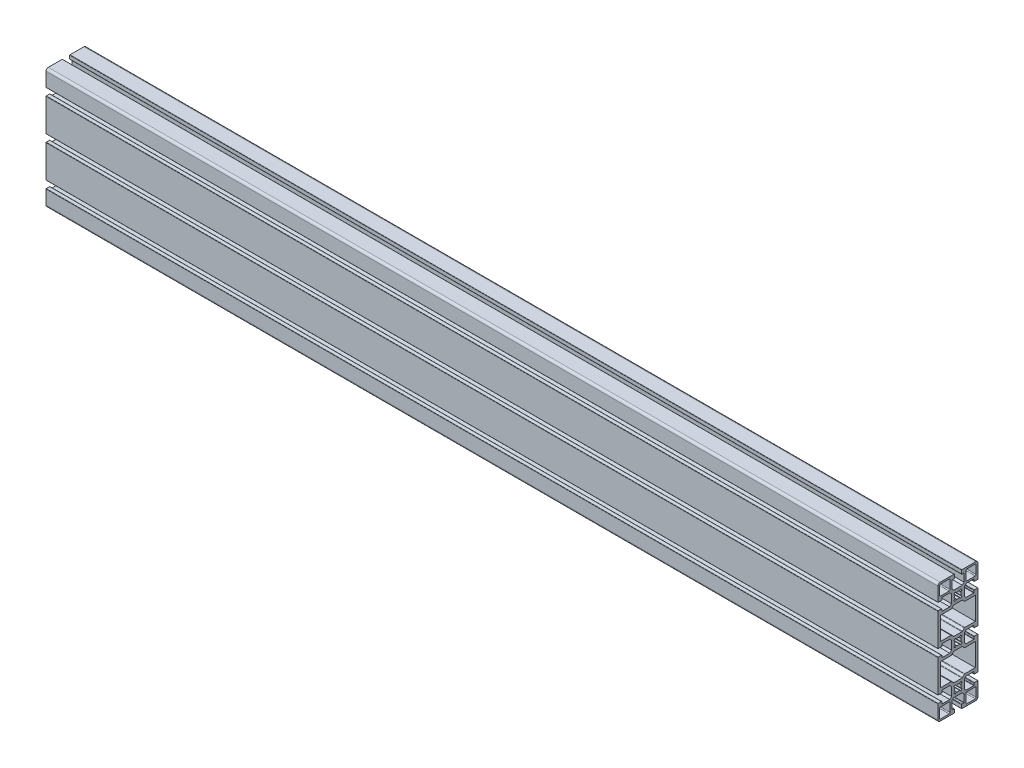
from build123d import *

# Parameters (mm, degrees)
F_45_SARJA_1_0115_45X135_L_6M_MUSTA_1_DEPTH = 1000


with BuildPart() as part:
    # Sketch12 → 45-sarja 1.0115 45X135 L 6M MUSTA_1 (new body)
    with BuildSketch(Plane(origin=(0, 0, 0), x_dir=(0, 0, -1), z_dir=(1, 0, 0))):
        with BuildLine():
            Line((-18.499999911, 41.027496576), (-22.199999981, 41.027496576))
            ThreePointArc((-22.199999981, 41.027496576), (-22.412132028, 40.939628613), (-22.5, 40.727496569))
            Line((-22.5, 40.727496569), (-22.5, 4.527493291))
            ThreePointArc((-22.5, 4.527493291), (-22.412131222, 4.315362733), (-22.199999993, 4.227495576))
            Line((-22.199999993, 4.227495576), (-18.499999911, 4.227495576))
            ThreePointArc((-18.499999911, 4.227495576), (-18.146446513, 4.373942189), (-17.9999999, 4.727495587))
            Line((-17.9999999, 4.727495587), (-17.9999999, 6.627500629))
            ThreePointArc((-17.9999999, 6.627500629), (-17.912130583, 6.839630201), (-17.699999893, 6.927496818))
            Line((-17.699999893, 6.927496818), (-9.199999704, 6.927496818))
            Line((-9.199999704, 6.927496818), (-7.19999966, 4.927496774))
            Line((-7.19999966, 4.927496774), (-7.19999966, -4.672505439))
            Line((-7.19999966, -4.672505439), (-9.199999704, -6.672505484))
            Line((-9.199999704, -6.672505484), (-17.699999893, -6.672505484))
            ThreePointArc((-17.699999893, -6.672505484), (-17.912131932, -6.584637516), (-17.9999999, -6.372505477))
            Line((-17.9999999, -6.372505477), (-17.9999999, -4.472502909))
            ThreePointArc((-17.9999999, -4.472502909), (-18.146447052, -4.118950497), (-18.499999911, -3.972504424))
            Line((-18.499999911, -3.972504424), (-22.199999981, -3.972504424))
            ThreePointArc((-22.199999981, -3.972504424), (-22.412132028, -4.060372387), (-22.5, -4.272504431))
            Line((-22.5, -4.272504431), (-22.5, -40.472507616))
            ThreePointArc((-22.5, -40.472507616), (-22.412131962, -40.684639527), (-22.199999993, -40.772507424))
            Line((-22.199999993, -40.772507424), (-18.499999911, -40.772507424))
            ThreePointArc((-18.499999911, -40.772507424), (-18.146446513, -40.626060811), (-17.9999999, -40.272507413))
            Line((-17.9999999, -40.272507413), (-17.9999999, -38.372508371))
            ThreePointArc((-17.9999999, -38.372508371), (-17.912131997, -38.160376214), (-17.699999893, -38.072508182))
            Line((-17.699999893, -38.072508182), (-9.199999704, -38.072508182))
            Line((-9.199999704, -38.072508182), (-7.19999966, -40.072508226))
            Line((-7.19999966, -40.072508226), (-7.19999966, -49.672506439))
            Line((-7.19999966, -49.672506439), (-9.199999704, -51.672507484))
            Line((-9.199999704, -51.672507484), (-17.699999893, -51.672507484))
            ThreePointArc((-17.699999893, -51.672507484), (-17.912131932, -51.584639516), (-17.9999999, -51.372507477))
            Line((-17.9999999, -51.372507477), (-17.9999999, -49.472507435))
            ThreePointArc((-17.9999999, -49.472507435), (-18.146446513, -49.118954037), (-18.499999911, -48.972507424))
            Line((-18.499999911, -48.972507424), (-22.199999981, -48.972507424))
            ThreePointArc((-22.199999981, -48.972507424), (-22.412132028, -49.060375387), (-22.5, -49.272507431))
            Line((-22.5, -49.272507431), (-22.5, -64.872507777))
            ThreePointArc((-22.5, -64.872507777), (-21.76777003, -66.640280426), (-19.999999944, -67.372516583))
            Line((-19.999999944, -67.372516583), (-4.399999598, -67.372516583))
            ThreePointArc((-4.399999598, -67.372516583), (-4.187867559, -67.284648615), (-4.099999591, -67.072516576))
            Line((-4.099999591, -67.072516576), (-4.099999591, -63.372516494))
            ThreePointArc((-4.099999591, -63.372516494), (-4.246446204, -63.018963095), (-4.599999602, -62.872516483))
            Line((-4.599999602, -62.872516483), (-6.499999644, -62.872516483))
            ThreePointArc((-6.499999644, -62.872516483), (-6.712131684, -62.784648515), (-6.799999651, -62.572516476))
            Line((-6.799999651, -62.572516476), (-6.799999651, -54.072516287))
            Line((-6.799999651, -54.072516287), (-4.799998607, -52.072516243))
            Line((-4.799998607, -52.072516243), (4.799999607, -52.072516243))
            Line((4.799999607, -52.072516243), (6.799999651, -54.072516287))
            Line((6.799999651, -54.072516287), (6.799999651, -62.572516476))
            ThreePointArc((6.799999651, -62.572516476), (6.712131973, -62.784648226), (6.500000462, -62.872516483))
            Line((6.500000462, -62.872516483), (4.600000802, -62.872516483))
            ThreePointArc((4.600000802, -62.872516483), (4.246447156, -63.01896296), (4.100000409, -63.372516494))
            Line((4.100000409, -63.372516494), (4.100000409, -67.072516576))
            ThreePointArc((4.100000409, -67.072516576), (4.187868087, -67.284648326), (4.399999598, -67.372516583))
            Line((4.399999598, -67.372516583), (19.999999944, -67.372516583))
            ThreePointArc((19.999999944, -67.372516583), (21.76777003, -66.640280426), (22.5, -64.872507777))
            Line((22.5, -64.872507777), (22.5, -49.272507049))
            ThreePointArc((22.5, -49.272507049), (22.412131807, -49.060375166), (22.199999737, -48.972507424))
            Line((22.199999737, -48.972507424), (18.499999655, -48.972507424))
            ThreePointArc((18.499999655, -48.972507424), (18.146446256, -49.118954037), (17.999999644, -49.472507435))
            Line((17.999999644, -49.472507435), (17.999999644, -51.372507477))
            ThreePointArc((17.999999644, -51.372507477), (17.912131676, -51.584639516), (17.699999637, -51.672507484))
            Line((17.699999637, -51.672507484), (9.200000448, -51.672507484))
            Line((9.200000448, -51.672507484), (7.200000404, -49.672506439))
            Line((7.200000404, -49.672506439), (7.200000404, -40.072508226))
            Line((7.200000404, -40.072508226), (9.200000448, -38.072508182))
            Line((9.200000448, -38.072508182), (17.699999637, -38.072508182))
            ThreePointArc((17.699999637, -38.072508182), (17.912131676, -38.160376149), (17.999999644, -38.372508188))
            Line((17.999999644, -38.372508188), (17.999999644, -40.272507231))
            ThreePointArc((17.999999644, -40.272507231), (18.146446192, -40.626060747), (18.499999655, -40.772507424))
            Line((18.499999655, -40.772507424), (22.2000005, -40.772507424))
            ThreePointArc((22.2000005, -40.772507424), (22.412132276, -40.684639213), (22.5, -40.472507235))
            Line((22.5, -40.472507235), (22.5, -4.272505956))
            ThreePointArc((22.5, -4.272505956), (22.412132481, -4.06037284), (22.199999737, -3.972504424))
            Line((22.199999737, -3.972504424), (18.499999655, -3.972504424))
            ThreePointArc((18.499999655, -3.972504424), (18.146446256, -4.118951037), (17.999999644, -4.472504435))
            Line((17.999999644, -4.472504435), (17.999999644, -6.372505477))
            ThreePointArc((17.999999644, -6.372505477), (17.912131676, -6.584637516), (17.699999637, -6.672505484))
            Line((17.699999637, -6.672505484), (9.200000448, -6.672505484))
            Line((9.200000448, -6.672505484), (7.200000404, -4.672505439))
            Line((7.200000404, -4.672505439), (7.200000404, 4.927496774))
            Line((7.200000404, 4.927496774), (9.200000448, 6.927496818))
            Line((9.200000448, 6.927496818), (17.699999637, 6.927496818))
            ThreePointArc((17.699999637, 6.927496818), (17.912131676, 6.839628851), (17.999999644, 6.627496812))
            Line((17.999999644, 6.627496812), (17.999999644, 4.727490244))
            ThreePointArc((17.999999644, 4.727490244), (18.146448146, 4.3739403), (18.499999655, 4.227495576))
            Line((18.499999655, 4.227495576), (22.2000005, 4.227495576))
            ThreePointArc((22.2000005, 4.227495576), (22.412130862, 4.315362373), (22.5, 4.527491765))
            Line((22.5, 4.527491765), (22.5, 40.727495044))
            ThreePointArc((22.5, 40.727495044), (22.412132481, 40.93962816), (22.199999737, 41.027496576))
            Line((22.199999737, 41.027496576), (18.499999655, 41.027496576))
            ThreePointArc((18.499999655, 41.027496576), (18.146446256, 40.881049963), (17.999999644, 40.527496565))
            Line((17.999999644, 40.527496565), (17.999999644, 38.627491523))
            ThreePointArc((17.999999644, 38.627491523), (17.912131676, 38.415359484), (17.699999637, 38.327491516))
            Line((17.699999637, 38.327491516), (9.200000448, 38.327491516))
            Line((9.200000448, 38.327491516), (7.200000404, 40.327491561))
            Line((7.200000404, 40.327491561), (7.200000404, 49.927497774))
            Line((7.200000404, 49.927497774), (9.200000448, 51.927497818))
            Line((9.200000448, 51.927497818), (17.699999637, 51.927497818))
            ThreePointArc((17.699999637, 51.927497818), (17.912131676, 51.839629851), (17.999999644, 51.627497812))
            Line((17.999999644, 51.627497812), (17.999999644, 49.727491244))
            ThreePointArc((17.999999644, 49.727491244), (18.146446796, 49.373938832), (18.499999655, 49.227492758))
            Line((18.499999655, 49.227492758), (22.2000005, 49.227492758))
            ThreePointArc((22.2000005, 49.227492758), (22.412132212, 49.315360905), (22.5, 49.527492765))
            Line((22.5, 49.527492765), (22.5, 65.127495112))
            ThreePointArc((22.5, 65.127495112), (21.767762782, 66.895254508), (19.999999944, 67.627483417))
            Line((19.999999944, 67.627483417), (4.399999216, 67.627483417))
            ThreePointArc((4.399999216, 67.627483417), (4.187867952, 67.539615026), (4.100000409, 67.327483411))
            Line((4.100000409, 67.327483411), (4.100000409, 63.627483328))
            ThreePointArc((4.100000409, 63.627483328), (4.246447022, 63.27392993), (4.60000042, 63.127483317))
            Line((4.60000042, 63.127483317), (6.500000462, 63.127483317))
            ThreePointArc((6.500000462, 63.127483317), (6.712131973, 63.039615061), (6.799999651, 62.827483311))
            Line((6.799999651, 62.827483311), (6.799999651, 54.327480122))
            Line((6.799999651, 54.327480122), (4.799999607, 52.327480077))
            Line((4.799999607, 52.327480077), (-4.799998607, 52.327480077))
            Line((-4.799998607, 52.327480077), (-6.799999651, 54.327480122))
            Line((-6.799999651, 54.327480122), (-6.799999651, 62.827483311))
            ThreePointArc((-6.799999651, 62.827483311), (-6.712131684, 63.03961535), (-6.499999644, 63.127483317))
            Line((-6.499999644, 63.127483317), (-4.599999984, 63.127483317))
            ThreePointArc((-4.599999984, 63.127483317), (-4.246446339, 63.273929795), (-4.099999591, 63.627483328))
            Line((-4.099999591, 63.627483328), (-4.099999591, 67.327480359))
            ThreePointArc((-4.099999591, 67.327480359), (-4.18786648, 67.539614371), (-4.399999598, 67.627483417))
            Line((-4.399999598, 67.627483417), (-19.999999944, 67.627483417))
            ThreePointArc((-19.999999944, 67.627483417), (-21.767762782, 66.895254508), (-22.5, 65.127495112))
            Line((-22.5, 65.127495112), (-22.5, 49.527494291))
            ThreePointArc((-22.5, 49.527494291), (-22.412131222, 49.315363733), (-22.199999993, 49.227496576))
            Line((-22.199999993, 49.227496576), (-18.499999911, 49.227496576))
            ThreePointArc((-18.499999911, 49.227496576), (-18.146446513, 49.373943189), (-17.9999999, 49.727496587))
            Line((-17.9999999, 49.727496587), (-17.9999999, 51.627501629))
            ThreePointArc((-17.9999999, 51.627501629), (-17.912130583, 51.839631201), (-17.699999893, 51.927497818))
            Line((-17.699999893, 51.927497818), (-9.199999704, 51.927497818))
            Line((-9.199999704, 51.927497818), (-7.19999966, 49.927497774))
            Line((-7.19999966, 49.927497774), (-7.19999966, 40.327491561))
            Line((-7.19999966, 40.327491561), (-9.199999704, 38.327491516))
            Line((-9.199999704, 38.327491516), (-17.699999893, 38.327491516))
            ThreePointArc((-17.699999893, 38.327491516), (-17.912131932, 38.415359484), (-17.9999999, 38.627491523))
            Line((-17.9999999, 38.627491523), (-17.9999999, 40.527498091))
            ThreePointArc((-17.9999999, 40.527498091), (-18.146447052, 40.881050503), (-18.499999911, 41.027496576))
        make_face()
        with BuildLine():
            Line((9.79999987, 53.927483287), (19.50000013, 53.927483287))
            ThreePointArc((19.50000013, 53.927483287), (20.207106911, 54.220376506), (20.50000013, 54.927483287))
            Line((20.50000013, 54.927483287), (20.50000013, 64.627483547))
            ThreePointArc((20.50000013, 64.627483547), (20.207106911, 65.334590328), (19.50000013, 65.627483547))
            Line((19.50000013, 65.627483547), (9.79999987, 65.627483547))
            ThreePointArc((9.79999987, 65.627483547), (9.092893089, 65.334590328), (8.79999987, 64.627483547))
            Line((8.79999987, 64.627483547), (8.79999987, 54.927483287))
            ThreePointArc((8.79999987, 54.927483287), (9.092893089, 54.220376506), (9.79999987, 53.927483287))
        make_face(mode=Mode.SUBTRACT)
        with BuildLine():
            Line((-20.5, 64.627483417), (-20.5, 54.927483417))
            ThreePointArc((-20.5, 54.927483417), (-20.207106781, 54.220376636), (-19.5, 53.927483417))
            Line((-19.5, 53.927483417), (-9.8, 53.927483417))
            ThreePointArc((-9.8, 53.927483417), (-9.092893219, 54.220376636), (-8.8, 54.927483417))
            Line((-8.8, 54.927483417), (-8.8, 64.627483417))
            ThreePointArc((-8.8, 64.627483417), (-9.092893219, 65.334590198), (-9.8, 65.627483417))
            Line((-9.8, 65.627483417), (-19.5, 65.627483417))
            ThreePointArc((-19.5, 65.627483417), (-20.207106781, 65.334590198), (-20.5, 64.627483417))
        make_face(mode=Mode.SUBTRACT)
        with BuildLine():
            Line((-4.384061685, 48.097331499), (-3.363290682, 47.076560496))
            ThreePointArc((-3.363290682, 47.076560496), (-3.279575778, 46.914173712), (-3.305579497, 46.733338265))
            ThreePointArc((-3.305579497, 46.733338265), (-3.675000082, 45.127483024), (-3.305579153, 43.521627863))
            ThreePointArc((-3.305579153, 43.521627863), (-3.279575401, 43.340792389), (-3.36329031, 43.178405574))
            Line((-3.36329031, 43.178405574), (-4.384061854, 42.15763403))
            ThreePointArc((-4.384061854, 42.15763403), (-4.471929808, 41.945502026), (-4.384061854, 41.733370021))
            Line((-4.384061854, 41.733370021), (-3.394112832, 40.743420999))
            ThreePointArc((-3.394112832, 40.743420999), (-3.181980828, 40.655553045), (-2.969848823, 40.743420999))
            Line((-2.969848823, 40.743420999), (-1.949077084, 41.764192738))
            ThreePointArc((-1.949077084, 41.764192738), (-1.7866903, 41.847907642), (-1.605854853, 41.821903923))
            ThreePointArc((-1.605854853, 41.821903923), (8.3e-08, 41.452483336), (1.605855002, 41.821903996))
            ThreePointArc((1.605855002, 41.821903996), (1.786690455, 41.847907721), (1.949077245, 41.764192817))
            Line((1.949077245, 41.764192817), (2.969848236, 40.743421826))
            ThreePointArc((2.969848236, 40.743421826), (3.181980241, 40.655553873), (3.394112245, 40.743421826))
            Line((3.394112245, 40.743421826), (4.384061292, 41.733370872))
            ThreePointArc((4.384061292, 41.733370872), (4.471929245, 41.945502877), (4.384061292, 42.157634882))
            Line((4.384061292, 42.157634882), (3.363290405, 43.178405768))
            ThreePointArc((3.363290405, 43.178405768), (3.279575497, 43.340792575), (3.30557924, 43.521628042))
            ThreePointArc((3.30557924, 43.521628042), (3.675000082, 45.127483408), (3.305579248, 46.733338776))
            ThreePointArc((3.305579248, 46.733338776), (3.279575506, 46.914174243), (3.363290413, 47.076561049))
            Line((3.363290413, 47.076561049), (4.384061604, 48.097332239))
            ThreePointArc((4.384061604, 48.097332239), (4.471929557, 48.309464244), (4.384061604, 48.521596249))
            Line((4.384061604, 48.521596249), (3.394112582, 49.511545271))
            ThreePointArc((3.394112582, 49.511545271), (3.181980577, 49.599413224), (2.969848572, 49.511545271))
            Line((2.969848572, 49.511545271), (1.949077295, 48.490773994))
            ThreePointArc((1.949077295, 48.490773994), (1.786690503, 48.407059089), (1.605855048, 48.433062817))
            ThreePointArc((1.605855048, 48.433062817), (-2.84e-07, 48.802483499), (-1.60585556, 48.433062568))
            ThreePointArc((-1.60585556, 48.433062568), (-1.786691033, 48.407058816), (-1.949077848, 48.490773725))
            Line((-1.949077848, 48.490773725), (-2.969848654, 49.51154453))
            ThreePointArc((-2.969848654, 49.51154453), (-3.181980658, 49.599412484), (-3.394112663, 49.51154453))
            Line((-3.394112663, 49.51154453), (-4.384061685, 48.521595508))
            ThreePointArc((-4.384061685, 48.521595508), (-4.471929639, 48.309463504), (-4.384061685, 48.097331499))
        make_face(mode=Mode.SUBTRACT)
        with BuildLine():
            Line((-5.092892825, 37.634590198), (-7.107098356, 35.620384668))
            ThreePointArc((-7.107098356, 35.620384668), (-7.431521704, 35.403611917), (-7.814205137, 35.327491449))
            Line((-7.814205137, 35.327491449), (-19.50000019, 35.327491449))
            Line((-19.50000019, 35.327491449), (-19.50000019, 9.927496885))
            Line((-19.50000019, 9.927496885), (-7.81422703, 9.927496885))
            ThreePointArc((-7.81422703, 9.927496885), (-7.431543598, 9.851376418), (-7.107120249, 9.634603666))
            Line((-7.107120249, 9.634603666), (-5.092893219, 7.620376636))
            ThreePointArc((-5.092893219, 7.620376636), (-4.76846987, 7.403603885), (-4.385786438, 7.327483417))
            Line((-4.385786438, 7.327483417), (4.385786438, 7.327483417))
            ThreePointArc((4.385786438, 7.327483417), (4.76846987, 7.403603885), (5.092893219, 7.620376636))
            Line((5.092893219, 7.620376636), (7.107120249, 9.634603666))
            ThreePointArc((7.107120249, 9.634603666), (7.431543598, 9.851376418), (7.81422703, 9.927496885))
            Line((7.81422703, 9.927496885), (19.499999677, 9.927496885))
            Line((19.499999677, 9.927496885), (19.499999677, 35.327491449))
            Line((19.499999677, 35.327491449), (7.814205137, 35.327491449))
            ThreePointArc((7.814205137, 35.327491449), (7.431521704, 35.403611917), (7.107098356, 35.620384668))
            Line((7.107098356, 35.620384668), (5.092892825, 37.634590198))
            ThreePointArc((5.092892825, 37.634590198), (4.768469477, 37.85136295), (4.385786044, 37.927483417))
            Line((4.385786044, 37.927483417), (-4.385786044, 37.927483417))
            ThreePointArc((-4.385786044, 37.927483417), (-4.768469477, 37.85136295), (-5.092892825, 37.634590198))
        make_face(mode=Mode.SUBTRACT)
        with BuildLine():
            Line((-4.384061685, 3.097331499), (-3.363290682, 2.076560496))
            ThreePointArc((-3.363290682, 2.076560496), (-3.279575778, 1.914173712), (-3.305579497, 1.733338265))
            ThreePointArc((-3.305579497, 1.733338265), (-3.675000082, 0.127483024), (-3.305579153, -1.478372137))
            ThreePointArc((-3.305579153, -1.478372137), (-3.279575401, -1.659207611), (-3.36329031, -1.821594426))
            Line((-3.36329031, -1.821594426), (-4.384061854, -2.84236597))
            ThreePointArc((-4.384061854, -2.84236597), (-4.471929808, -3.054497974), (-4.384061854, -3.266629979))
            Line((-4.384061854, -3.266629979), (-3.394112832, -4.256579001))
            ThreePointArc((-3.394112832, -4.256579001), (-3.181980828, -4.344446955), (-2.969848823, -4.256579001))
            Line((-2.969848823, -4.256579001), (-1.949077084, -3.235807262))
            ThreePointArc((-1.949077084, -3.235807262), (-1.7866903, -3.152092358), (-1.605854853, -3.178096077))
            ThreePointArc((-1.605854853, -3.178096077), (8.3e-08, -3.547516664), (1.605855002, -3.178096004))
            ThreePointArc((1.605855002, -3.178096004), (1.786690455, -3.152092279), (1.949077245, -3.235807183))
            Line((1.949077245, -3.235807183), (2.969848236, -4.256578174))
            ThreePointArc((2.969848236, -4.256578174), (3.181980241, -4.344446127), (3.394112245, -4.256578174))
            Line((3.394112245, -4.256578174), (4.384061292, -3.266629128))
            ThreePointArc((4.384061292, -3.266629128), (4.471929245, -3.054497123), (4.384061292, -2.842365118))
            Line((4.384061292, -2.842365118), (3.363290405, -1.821594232))
            ThreePointArc((3.363290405, -1.821594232), (3.279575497, -1.659207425), (3.30557924, -1.478371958))
            ThreePointArc((3.30557924, -1.478371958), (3.675000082, 0.127483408), (3.305579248, 1.733338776))
            ThreePointArc((3.305579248, 1.733338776), (3.279575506, 1.914174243), (3.363290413, 2.076561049))
            Line((3.363290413, 2.076561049), (4.384061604, 3.097332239))
            ThreePointArc((4.384061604, 3.097332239), (4.471929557, 3.309464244), (4.384061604, 3.521596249))
            Line((4.384061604, 3.521596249), (3.394112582, 4.511545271))
            ThreePointArc((3.394112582, 4.511545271), (3.181980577, 4.599413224), (2.969848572, 4.511545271))
            Line((2.969848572, 4.511545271), (1.949077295, 3.490773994))
            ThreePointArc((1.949077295, 3.490773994), (1.786690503, 3.407059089), (1.605855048, 3.433062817))
            ThreePointArc((1.605855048, 3.433062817), (-2.84e-07, 3.802483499), (-1.60585556, 3.433062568))
            ThreePointArc((-1.60585556, 3.433062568), (-1.786691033, 3.407058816), (-1.949077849, 3.490773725))
            Line((-1.949077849, 3.490773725), (-2.969848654, 4.51154453))
            ThreePointArc((-2.969848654, 4.51154453), (-3.181980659, 4.599412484), (-3.394112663, 4.51154453))
            Line((-3.394112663, 4.51154453), (-4.384061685, 3.521595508))
            ThreePointArc((-4.384061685, 3.521595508), (-4.471929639, 3.309463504), (-4.384061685, 3.097331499))
        make_face(mode=Mode.SUBTRACT)
        with BuildLine():
            Line((-5.092893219, -7.365409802), (-7.107120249, -9.379636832))
            ThreePointArc((-7.107120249, -9.379636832), (-7.431543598, -9.596409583), (-7.81422703, -9.672530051))
            Line((-7.81422703, -9.672530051), (-19.50000019, -9.672530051))
            Line((-19.50000019, -9.672530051), (-19.50000019, -35.072524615))
            Line((-19.50000019, -35.072524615), (-7.814205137, -35.072524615))
            ThreePointArc((-7.814205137, -35.072524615), (-7.431521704, -35.148645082), (-7.107098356, -35.365417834))
            Line((-7.107098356, -35.365417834), (-5.092892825, -37.379623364))
            ThreePointArc((-5.092892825, -37.379623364), (-4.768469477, -37.596396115), (-4.385786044, -37.672516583))
            Line((-4.385786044, -37.672516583), (4.385786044, -37.672516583))
            ThreePointArc((4.385786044, -37.672516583), (4.768469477, -37.596396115), (5.092892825, -37.379623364))
            Line((5.092892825, -37.379623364), (7.107098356, -35.365417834))
            ThreePointArc((7.107098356, -35.365417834), (7.431521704, -35.148645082), (7.814205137, -35.072524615))
            Line((7.814205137, -35.072524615), (19.499999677, -35.072524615))
            Line((19.499999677, -35.072524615), (19.499999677, -9.672530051))
            Line((19.499999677, -9.672530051), (7.81422703, -9.672530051))
            ThreePointArc((7.81422703, -9.672530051), (7.431543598, -9.596409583), (7.107120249, -9.379636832))
            Line((7.107120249, -9.379636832), (5.092893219, -7.365409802))
            ThreePointArc((5.092893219, -7.365409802), (4.76846987, -7.14863705), (4.385786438, -7.072516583))
            Line((4.385786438, -7.072516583), (-4.385786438, -7.072516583))
            ThreePointArc((-4.385786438, -7.072516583), (-4.76846987, -7.14863705), (-5.092893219, -7.365409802))
        make_face(mode=Mode.SUBTRACT)
        with BuildLine():
            Line((-4.384061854, -41.902667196), (-3.36329031, -42.92343874))
            ThreePointArc((-3.36329031, -42.92343874), (-3.279575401, -43.085825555), (-3.305579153, -43.266661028))
            ThreePointArc((-3.305579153, -43.266661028), (-3.675000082, -44.87251619), (-3.305579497, -46.47837143))
            ThreePointArc((-3.305579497, -46.47837143), (-3.279575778, -46.659206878), (-3.363290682, -46.821593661))
            Line((-3.363290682, -46.821593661), (-4.384061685, -47.842364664))
            ThreePointArc((-4.384061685, -47.842364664), (-4.471929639, -48.054496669), (-4.384061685, -48.266628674))
            Line((-4.384061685, -48.266628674), (-3.394112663, -49.256577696))
            ThreePointArc((-3.394112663, -49.256577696), (-3.181980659, -49.344445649), (-2.969848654, -49.256577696))
            Line((-2.969848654, -49.256577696), (-1.949077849, -48.23580689))
            ThreePointArc((-1.949077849, -48.23580689), (-1.786691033, -48.152091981), (-1.60585556, -48.178095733))
            ThreePointArc((-1.60585556, -48.178095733), (-2.84e-07, -48.547516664), (1.605855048, -48.178095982))
            ThreePointArc((1.605855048, -48.178095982), (1.786690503, -48.152092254), (1.949077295, -48.235807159))
            Line((1.949077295, -48.235807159), (2.969848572, -49.256578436))
            ThreePointArc((2.969848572, -49.256578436), (3.181980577, -49.34444639), (3.394112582, -49.256578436))
            Line((3.394112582, -49.256578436), (4.384061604, -48.266629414))
            ThreePointArc((4.384061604, -48.266629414), (4.471929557, -48.05449741), (4.384061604, -47.842365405))
            Line((4.384061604, -47.842365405), (3.363290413, -46.821594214))
            ThreePointArc((3.363290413, -46.821594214), (3.279575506, -46.659207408), (3.305579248, -46.478371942))
            ThreePointArc((3.305579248, -46.478371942), (3.675000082, -44.872516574), (3.30557924, -43.266661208))
            ThreePointArc((3.30557924, -43.266661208), (3.279575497, -43.085825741), (3.363290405, -42.923438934))
            Line((3.363290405, -42.923438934), (4.384061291, -41.902668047))
            ThreePointArc((4.384061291, -41.902668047), (4.471929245, -41.690536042), (4.384061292, -41.478404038))
            Line((4.384061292, -41.478404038), (3.394112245, -40.488454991))
            ThreePointArc((3.394112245, -40.488454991), (3.181980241, -40.400587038), (2.969848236, -40.488454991))
            Line((2.969848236, -40.488454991), (1.949077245, -41.509225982))
            ThreePointArc((1.949077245, -41.509225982), (1.786690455, -41.592940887), (1.605855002, -41.566937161))
            ThreePointArc((1.605855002, -41.566937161), (8.3e-08, -41.197516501), (-1.605854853, -41.566937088))
            ThreePointArc((-1.605854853, -41.566937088), (-1.7866903, -41.592940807), (-1.949077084, -41.509225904))
            Line((-1.949077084, -41.509225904), (-2.969848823, -40.488454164))
            ThreePointArc((-2.969848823, -40.488454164), (-3.181980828, -40.400586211), (-3.394112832, -40.488454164))
            Line((-3.394112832, -40.488454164), (-4.384061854, -41.478403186))
            ThreePointArc((-4.384061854, -41.478403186), (-4.471929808, -41.690535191), (-4.384061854, -41.902667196))
        make_face(mode=Mode.SUBTRACT)
        with BuildLine():
            Line((-19.5, -65.372516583), (-9.8, -65.372516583))
            ThreePointArc((-9.8, -65.372516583), (-9.092893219, -65.079623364), (-8.8, -64.372516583))
            Line((-8.8, -64.372516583), (-8.8, -54.672516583))
            ThreePointArc((-8.8, -54.672516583), (-9.092893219, -53.965409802), (-9.8, -53.672516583))
            Line((-9.8, -53.672516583), (-19.5, -53.672516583))
            ThreePointArc((-19.5, -53.672516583), (-20.207106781, -53.965409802), (-20.5, -54.672516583))
            Line((-20.5, -54.672516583), (-20.5, -64.372516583))
            ThreePointArc((-20.5, -64.372516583), (-20.207106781, -65.079623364), (-19.5, -65.372516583))
        make_face(mode=Mode.SUBTRACT)
        with BuildLine():
            Line((8.79999987, -54.672516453), (8.79999987, -64.372516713))
            ThreePointArc((8.79999987, -64.372516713), (9.092893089, -65.079623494), (9.79999987, -65.372516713))
            Line((9.79999987, -65.372516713), (19.50000013, -65.372516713))
            ThreePointArc((19.50000013, -65.372516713), (20.207106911, -65.079623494), (20.50000013, -64.372516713))
            Line((20.50000013, -64.372516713), (20.50000013, -54.672516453))
            ThreePointArc((20.50000013, -54.672516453), (20.207106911, -53.965409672), (19.50000013, -53.672516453))
            Line((19.50000013, -53.672516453), (9.79999987, -53.672516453))
            ThreePointArc((9.79999987, -53.672516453), (9.092893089, -53.965409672), (8.79999987, -54.672516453))
        make_face(mode=Mode.SUBTRACT)
    extrude(amount=F_45_SARJA_1_0115_45X135_L_6M_MUSTA_1_DEPTH)


solid = part.part
